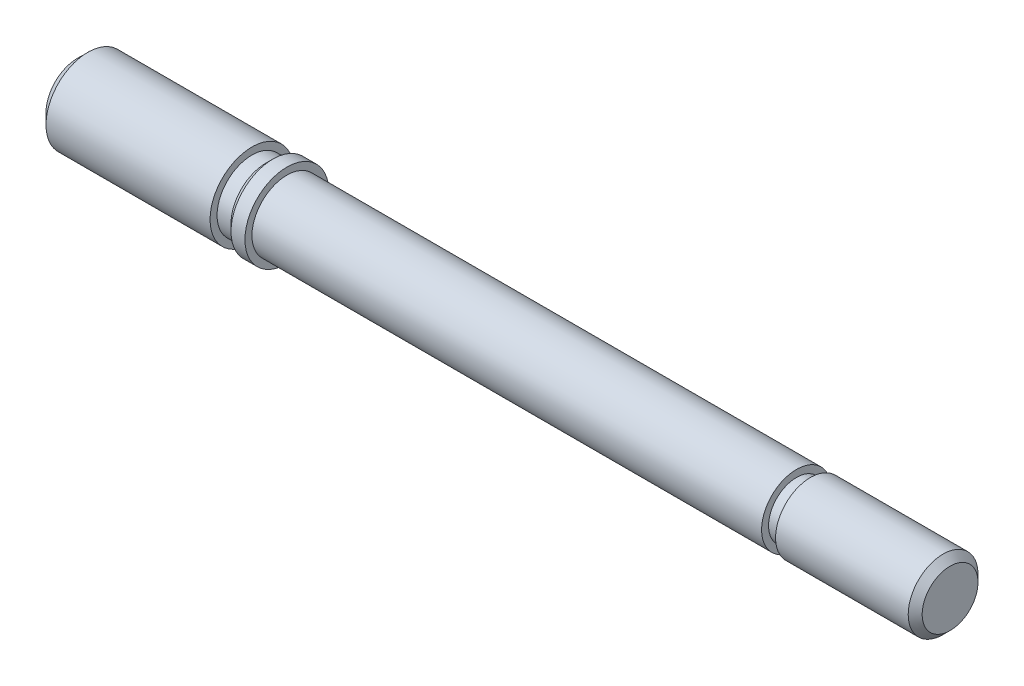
ISO-10303-21;
HEADER;
FILE_DESCRIPTION(('STEP AP214'),'2;1');
FILE_NAME('part.step','',(''),(''),'','','');
FILE_SCHEMA(('AUTOMOTIVE_DESIGN { 1 0 10303 214 1 1 1 1 }'));
ENDSEC;
DATA;
#1=APPLICATION_CONTEXT('core data for automotive mechanical design processes');
#2=APPLICATION_PROTOCOL_DEFINITION('international standard','automotive_design',2000,#1);
#3=PRODUCT_CONTEXT('',#1,'mechanical');
#4=PRODUCT('Part','Part','',(#3));
#5=PRODUCT_RELATED_PRODUCT_CATEGORY('part','',(#4));
#6=PRODUCT_DEFINITION_FORMATION('','',#4);
#7=PRODUCT_DEFINITION_CONTEXT('part definition',#1,'design');
#8=PRODUCT_DEFINITION('design','',#6,#7);
#9=PRODUCT_DEFINITION_SHAPE('','',#8);
#10=(LENGTH_UNIT() NAMED_UNIT(*) SI_UNIT(.MILLI.,.METRE.));
#11=(NAMED_UNIT(*) PLANE_ANGLE_UNIT() SI_UNIT($,.RADIAN.));
#12=(NAMED_UNIT(*) SI_UNIT($,.STERADIAN.) SOLID_ANGLE_UNIT());
#13=UNCERTAINTY_MEASURE_WITH_UNIT(LENGTH_MEASURE(1.E-05),#10,'distance_accuracy_value','');
#14=(GEOMETRIC_REPRESENTATION_CONTEXT(3) GLOBAL_UNCERTAINTY_ASSIGNED_CONTEXT((#13)) GLOBAL_UNIT_ASSIGNED_CONTEXT((#10,
#11,#12)) REPRESENTATION_CONTEXT('',''));
#15=CARTESIAN_POINT('',(0.,0.,0.));
#16=DIRECTION('',(0.,0.,1.));
#17=DIRECTION('',(1.,0.,0.));
#18=AXIS2_PLACEMENT_3D('',#15,#16,#17);
#19=CARTESIAN_POINT('',(0.,0.,0.));
#20=DIRECTION('',(1.,0.,0.));
#21=DIRECTION('',(0.,0.,-1.));
#22=AXIS2_PLACEMENT_3D('',#19,#20,#21);
#23=PLANE('',#22);
#24=CARTESIAN_POINT('',(0.,0.,0.));
#25=DIRECTION('',(-1.,0.,0.));
#26=DIRECTION('',(0.,0.,1.));
#27=AXIS2_PLACEMENT_3D('',#24,#25,#26);
#28=CIRCLE('',#27,4.49999999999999);
#29=CARTESIAN_POINT('',(0.,0.,4.49999999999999));
#30=VERTEX_POINT('',#29);
#31=EDGE_CURVE('E10',#30,#30,#28,.T.);
#32=ORIENTED_EDGE('',*,*,#31,.T.);
#33=EDGE_LOOP('',(#32));
#34=FACE_BOUND('',#33,.T.);
#35=ADVANCED_FACE('F35',(#34),#23,.F.);
#36=CARTESIAN_POINT('',(1.5,0.,0.));
#37=DIRECTION('',(1.,0.,0.));
#38=DIRECTION('',(0.,0.,-1.));
#39=AXIS2_PLACEMENT_3D('',#36,#37,#38);
#40=CONICAL_SURFACE('',#39,6.,0.785398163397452);
#41=ORIENTED_EDGE('',*,*,#31,.F.);
#42=EDGE_LOOP('',(#41));
#43=FACE_BOUND('',#42,.T.);
#44=CARTESIAN_POINT('',(1.5,0.,0.));
#45=DIRECTION('',(-1.,0.,0.));
#46=DIRECTION('',(0.,0.,1.));
#47=AXIS2_PLACEMENT_3D('',#44,#45,#46);
#48=CIRCLE('',#47,6.);
#49=CARTESIAN_POINT('',(1.5,0.,6.));
#50=VERTEX_POINT('',#49);
#51=EDGE_CURVE('E41',#50,#50,#48,.T.);
#52=ORIENTED_EDGE('',*,*,#51,.T.);
#53=EDGE_LOOP('',(#52));
#54=FACE_BOUND('',#53,.T.);
#55=ADVANCED_FACE('F97',(#43,#54),#40,.T.);
#56=CARTESIAN_POINT('',(-8.38774068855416,0.,0.));
#57=DIRECTION('',(-1.,0.,0.));
#58=DIRECTION('',(0.,0.,1.));
#59=AXIS2_PLACEMENT_3D('',#56,#57,#58);
#60=CYLINDRICAL_SURFACE('',#59,6.);
#61=ORIENTED_EDGE('',*,*,#51,.F.);
#62=EDGE_LOOP('',(#61));
#63=FACE_BOUND('',#62,.T.);
#64=CARTESIAN_POINT('',(25.,0.,0.));
#65=DIRECTION('',(-1.,0.,0.));
#66=DIRECTION('',(0.,0.,1.));
#67=AXIS2_PLACEMENT_3D('',#64,#65,#66);
#68=CIRCLE('',#67,6.);
#69=CARTESIAN_POINT('',(25.,0.,6.));
#70=VERTEX_POINT('',#69);
#71=EDGE_CURVE('E45',#70,#70,#68,.T.);
#72=ORIENTED_EDGE('',*,*,#71,.T.);
#73=EDGE_LOOP('',(#72));
#74=FACE_BOUND('',#73,.T.);
#75=ADVANCED_FACE('F101',(#63,#74),#60,.T.);
#76=CARTESIAN_POINT('',(25.,6.,0.));
#77=DIRECTION('',(-1.,0.,0.));
#78=DIRECTION('',(0.,0.,1.));
#79=AXIS2_PLACEMENT_3D('',#76,#77,#78);
#80=PLANE('',#79);
#81=ORIENTED_EDGE('',*,*,#71,.F.);
#82=EDGE_LOOP('',(#81));
#83=FACE_BOUND('',#82,.T.);
#84=CARTESIAN_POINT('',(25.,0.,0.));
#85=DIRECTION('',(-1.,0.,0.));
#86=DIRECTION('',(0.,0.,1.));
#87=AXIS2_PLACEMENT_3D('',#84,#85,#86);
#88=CIRCLE('',#87,5.);
#89=CARTESIAN_POINT('',(25.,0.,5.));
#90=VERTEX_POINT('',#89);
#91=EDGE_CURVE('E49',#90,#90,#88,.T.);
#92=ORIENTED_EDGE('',*,*,#91,.T.);
#93=EDGE_LOOP('',(#92));
#94=FACE_BOUND('',#93,.T.);
#95=ADVANCED_FACE('F106',(#83,#94),#80,.F.);
#96=CARTESIAN_POINT('',(-8.38774068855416,0.,0.));
#97=DIRECTION('',(-1.,0.,0.));
#98=DIRECTION('',(0.,0.,1.));
#99=AXIS2_PLACEMENT_3D('',#96,#97,#98);
#100=CYLINDRICAL_SURFACE('',#99,5.);
#101=ORIENTED_EDGE('',*,*,#91,.F.);
#102=EDGE_LOOP('',(#101));
#103=FACE_BOUND('',#102,.T.);
#104=CARTESIAN_POINT('',(27.,0.,0.));
#105=DIRECTION('',(-1.,0.,0.));
#106=DIRECTION('',(0.,0.,1.));
#107=AXIS2_PLACEMENT_3D('',#104,#105,#106);
#108=CIRCLE('',#107,5.);
#109=CARTESIAN_POINT('',(27.,0.,5.));
#110=VERTEX_POINT('',#109);
#111=EDGE_CURVE('E54',#110,#110,#108,.T.);
#112=ORIENTED_EDGE('',*,*,#111,.T.);
#113=EDGE_LOOP('',(#112));
#114=FACE_BOUND('',#113,.T.);
#115=ADVANCED_FACE('F112',(#103,#114),#100,.T.);
#116=CARTESIAN_POINT('',(28.,0.,0.));
#117=DIRECTION('',(1.,0.,0.));
#118=DIRECTION('',(0.,0.,-1.));
#119=AXIS2_PLACEMENT_3D('',#116,#117,#118);
#120=CONICAL_SURFACE('',#119,6.00000000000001,0.785398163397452);
#121=ORIENTED_EDGE('',*,*,#111,.F.);
#122=EDGE_LOOP('',(#121));
#123=FACE_BOUND('',#122,.T.);
#124=CARTESIAN_POINT('',(28.,0.,0.));
#125=DIRECTION('',(-1.,0.,0.));
#126=DIRECTION('',(0.,0.,1.));
#127=AXIS2_PLACEMENT_3D('',#124,#125,#126);
#128=CIRCLE('',#127,6.00000000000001);
#129=CARTESIAN_POINT('',(28.,0.,6.00000000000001));
#130=VERTEX_POINT('',#129);
#131=EDGE_CURVE('E57',#130,#130,#128,.T.);
#132=ORIENTED_EDGE('',*,*,#131,.T.);
#133=EDGE_LOOP('',(#132));
#134=FACE_BOUND('',#133,.T.);
#135=ADVANCED_FACE('F116',(#123,#134),#120,.T.);
#136=CARTESIAN_POINT('',(-8.38774068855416,0.,0.));
#137=DIRECTION('',(-1.,0.,0.));
#138=DIRECTION('',(0.,0.,1.));
#139=AXIS2_PLACEMENT_3D('',#136,#137,#138);
#140=CYLINDRICAL_SURFACE('',#139,6.00000000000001);
#141=ORIENTED_EDGE('',*,*,#131,.F.);
#142=EDGE_LOOP('',(#141));
#143=FACE_BOUND('',#142,.T.);
#144=CARTESIAN_POINT('',(30.,0.,0.));
#145=DIRECTION('',(-1.,0.,0.));
#146=DIRECTION('',(0.,0.,1.));
#147=AXIS2_PLACEMENT_3D('',#144,#145,#146);
#148=CIRCLE('',#147,6.00000000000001);
#149=CARTESIAN_POINT('',(30.,0.,6.00000000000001));
#150=VERTEX_POINT('',#149);
#151=EDGE_CURVE('E60',#150,#150,#148,.T.);
#152=ORIENTED_EDGE('',*,*,#151,.T.);
#153=EDGE_LOOP('',(#152));
#154=FACE_BOUND('',#153,.T.);
#155=ADVANCED_FACE('F120',(#143,#154),#140,.T.);
#156=CARTESIAN_POINT('',(30.,6.00000000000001,0.));
#157=DIRECTION('',(-1.,0.,0.));
#158=DIRECTION('',(0.,0.,1.));
#159=AXIS2_PLACEMENT_3D('',#156,#157,#158);
#160=PLANE('',#159);
#161=ORIENTED_EDGE('',*,*,#151,.F.);
#162=EDGE_LOOP('',(#161));
#163=FACE_BOUND('',#162,.T.);
#164=CARTESIAN_POINT('',(30.,0.,0.));
#165=DIRECTION('',(-1.,0.,0.));
#166=DIRECTION('',(0.,0.,1.));
#167=AXIS2_PLACEMENT_3D('',#164,#165,#166);
#168=CIRCLE('',#167,5.);
#169=CARTESIAN_POINT('',(30.,0.,5.));
#170=VERTEX_POINT('',#169);
#171=EDGE_CURVE('E63',#170,#170,#168,.T.);
#172=ORIENTED_EDGE('',*,*,#171,.T.);
#173=EDGE_LOOP('',(#172));
#174=FACE_BOUND('',#173,.T.);
#175=ADVANCED_FACE('F124',(#163,#174),#160,.F.);
#176=CARTESIAN_POINT('',(-8.38774068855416,0.,0.));
#177=DIRECTION('',(-1.,0.,0.));
#178=DIRECTION('',(0.,0.,1.));
#179=AXIS2_PLACEMENT_3D('',#176,#177,#178);
#180=CYLINDRICAL_SURFACE('',#179,5.);
#181=ORIENTED_EDGE('',*,*,#171,.F.);
#182=EDGE_LOOP('',(#181));
#183=FACE_BOUND('',#182,.T.);
#184=CARTESIAN_POINT('',(103.,0.,0.));
#185=DIRECTION('',(-1.,0.,0.));
#186=DIRECTION('',(0.,0.,1.));
#187=AXIS2_PLACEMENT_3D('',#184,#185,#186);
#188=CIRCLE('',#187,5.);
#189=CARTESIAN_POINT('',(103.,0.,5.));
#190=VERTEX_POINT('',#189);
#191=EDGE_CURVE('E66',#190,#190,#188,.T.);
#192=ORIENTED_EDGE('',*,*,#191,.T.);
#193=EDGE_LOOP('',(#192));
#194=FACE_BOUND('',#193,.T.);
#195=ADVANCED_FACE('F128',(#183,#194),#180,.T.);
#196=CARTESIAN_POINT('',(103.,5.,0.));
#197=DIRECTION('',(-1.,0.,0.));
#198=DIRECTION('',(0.,0.,1.));
#199=AXIS2_PLACEMENT_3D('',#196,#197,#198);
#200=PLANE('',#199);
#201=ORIENTED_EDGE('',*,*,#191,.F.);
#202=EDGE_LOOP('',(#201));
#203=FACE_BOUND('',#202,.T.);
#204=CARTESIAN_POINT('',(103.,0.,0.));
#205=DIRECTION('',(-1.,0.,0.));
#206=DIRECTION('',(0.,0.,1.));
#207=AXIS2_PLACEMENT_3D('',#204,#205,#206);
#208=CIRCLE('',#207,4.);
#209=CARTESIAN_POINT('',(103.,0.,4.));
#210=VERTEX_POINT('',#209);
#211=EDGE_CURVE('E69',#210,#210,#208,.T.);
#212=ORIENTED_EDGE('',*,*,#211,.T.);
#213=EDGE_LOOP('',(#212));
#214=FACE_BOUND('',#213,.T.);
#215=ADVANCED_FACE('F132',(#203,#214),#200,.F.);
#216=CARTESIAN_POINT('',(-8.38774068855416,0.,0.));
#217=DIRECTION('',(-1.,0.,0.));
#218=DIRECTION('',(0.,0.,1.));
#219=AXIS2_PLACEMENT_3D('',#216,#217,#218);
#220=CYLINDRICAL_SURFACE('',#219,4.);
#221=ORIENTED_EDGE('',*,*,#211,.F.);
#222=EDGE_LOOP('',(#221));
#223=FACE_BOUND('',#222,.T.);
#224=CARTESIAN_POINT('',(105.,0.,0.));
#225=DIRECTION('',(-1.,0.,0.));
#226=DIRECTION('',(0.,0.,1.));
#227=AXIS2_PLACEMENT_3D('',#224,#225,#226);
#228=CIRCLE('',#227,4.);
#229=CARTESIAN_POINT('',(105.,0.,4.));
#230=VERTEX_POINT('',#229);
#231=EDGE_CURVE('E72',#230,#230,#228,.T.);
#232=ORIENTED_EDGE('',*,*,#231,.T.);
#233=EDGE_LOOP('',(#232));
#234=FACE_BOUND('',#233,.T.);
#235=ADVANCED_FACE('F136',(#223,#234),#220,.T.);
#236=CARTESIAN_POINT('',(105.,4.,0.));
#237=DIRECTION('',(1.,0.,0.));
#238=DIRECTION('',(0.,0.,-1.));
#239=AXIS2_PLACEMENT_3D('',#236,#237,#238);
#240=PLANE('',#239);
#241=ORIENTED_EDGE('',*,*,#231,.F.);
#242=EDGE_LOOP('',(#241));
#243=FACE_BOUND('',#242,.T.);
#244=CARTESIAN_POINT('',(105.,0.,0.));
#245=DIRECTION('',(-1.,0.,0.));
#246=DIRECTION('',(0.,0.,1.));
#247=AXIS2_PLACEMENT_3D('',#244,#245,#246);
#248=CIRCLE('',#247,5.);
#249=CARTESIAN_POINT('',(105.,0.,5.));
#250=VERTEX_POINT('',#249);
#251=EDGE_CURVE('E75',#250,#250,#248,.T.);
#252=ORIENTED_EDGE('',*,*,#251,.T.);
#253=EDGE_LOOP('',(#252));
#254=FACE_BOUND('',#253,.T.);
#255=ADVANCED_FACE('F140',(#243,#254),#240,.F.);
#256=CARTESIAN_POINT('',(-8.38774068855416,0.,0.));
#257=DIRECTION('',(-1.,0.,0.));
#258=DIRECTION('',(0.,0.,1.));
#259=AXIS2_PLACEMENT_3D('',#256,#257,#258);
#260=CYLINDRICAL_SURFACE('',#259,5.);
#261=ORIENTED_EDGE('',*,*,#251,.F.);
#262=EDGE_LOOP('',(#261));
#263=FACE_BOUND('',#262,.T.);
#264=CARTESIAN_POINT('',(124.,0.,0.));
#265=DIRECTION('',(-1.,0.,0.));
#266=DIRECTION('',(0.,0.,1.));
#267=AXIS2_PLACEMENT_3D('',#264,#265,#266);
#268=CIRCLE('',#267,5.);
#269=CARTESIAN_POINT('',(124.,0.,5.));
#270=VERTEX_POINT('',#269);
#271=EDGE_CURVE('E78',#270,#270,#268,.T.);
#272=ORIENTED_EDGE('',*,*,#271,.T.);
#273=EDGE_LOOP('',(#272));
#274=FACE_BOUND('',#273,.T.);
#275=ADVANCED_FACE('F93',(#263,#274),#260,.T.);
#276=CARTESIAN_POINT('',(125.,0.,0.));
#277=DIRECTION('',(-1.,0.,0.));
#278=DIRECTION('',(0.,0.,1.));
#279=AXIS2_PLACEMENT_3D('',#276,#277,#278);
#280=CONICAL_SURFACE('',#279,4.,0.785398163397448);
#281=ORIENTED_EDGE('',*,*,#271,.F.);
#282=EDGE_LOOP('',(#281));
#283=FACE_BOUND('',#282,.T.);
#284=CARTESIAN_POINT('',(125.,0.,0.));
#285=DIRECTION('',(-1.,0.,0.));
#286=DIRECTION('',(0.,0.,1.));
#287=AXIS2_PLACEMENT_3D('',#284,#285,#286);
#288=CIRCLE('',#287,4.);
#289=CARTESIAN_POINT('',(125.,0.,4.));
#290=VERTEX_POINT('',#289);
#291=EDGE_CURVE('E81',#290,#290,#288,.T.);
#292=ORIENTED_EDGE('',*,*,#291,.T.);
#293=EDGE_LOOP('',(#292));
#294=FACE_BOUND('',#293,.T.);
#295=ADVANCED_FACE('F85',(#283,#294),#280,.T.);
#296=CARTESIAN_POINT('',(125.,4.,0.));
#297=DIRECTION('',(-1.,0.,0.));
#298=DIRECTION('',(0.,0.,1.));
#299=AXIS2_PLACEMENT_3D('',#296,#297,#298);
#300=PLANE('',#299);
#301=ORIENTED_EDGE('',*,*,#291,.F.);
#302=EDGE_LOOP('',(#301));
#303=FACE_BOUND('',#302,.T.);
#304=ADVANCED_FACE('F87',(#303),#300,.F.);
#305=CLOSED_SHELL('',(#35,#55,#75,#95,#115,#135,#155,#175,#195,#215,#235,#255,#275,#295,#304));
#306=MANIFOLD_SOLID_BREP('B2',#305);
#307=ADVANCED_BREP_SHAPE_REPRESENTATION('',(#18,#306),#14);
#308=SHAPE_DEFINITION_REPRESENTATION(#9,#307);
ENDSEC;
END-ISO-10303-21;
